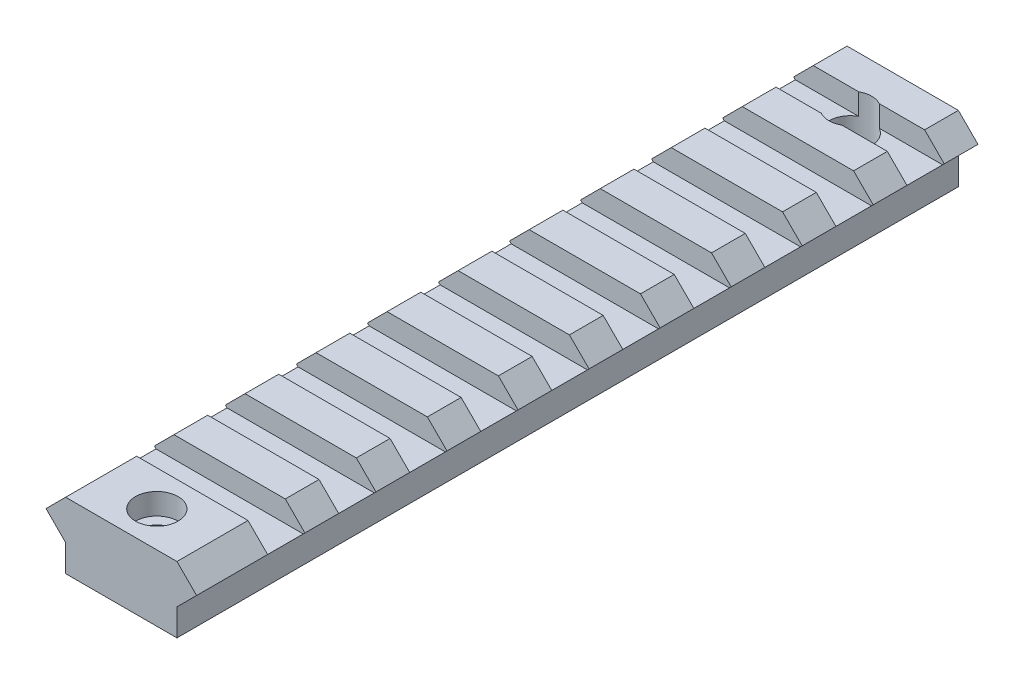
from build123d import *

# Parameters (mm, degrees)
EXTRUDE_1_DEPTH          = 110
SKETCH_3_W               = 21.2
SKETCH_3_H               = 5.25
CUT_EXTRUDE_1_DEPTH      = 3
SKETCH_4_R               = 3
CUT_EXTRUDE_2_DEPTH      = 3
SKETCH_5_R               = 1.5
CUT_EXTRUDE_3_DEPTH      = 114.880982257
SKETCH_6_R               = 1.5
CUT_EXTRUDE_4_DEPTH      = 114.880982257
CUT_EXTRUDE_5_DEPTH      = 114.880982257
CUT_EXTRUDE_5_DEPTH_BACK = 3
SKETCH_7_R               = 3


with BuildPart() as part:
    # Sketch 2 → Extrude 1 (new body)
    with BuildSketch(Plane.XY):
        Polygon((-26.026243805, 24.439556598), (-26.026243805, 29.969556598), (-28.791243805, 27.204556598), align=None)
        Polygon((-10.356243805, 29.969556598), (-26.026243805, 29.969556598), (-26.026243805, 24.439556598), (-26.026243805, 20.649556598), (-10.356243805, 20.649556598), (-10.356243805, 24.439556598), align=None)
        Polygon((-7.591243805, 27.204556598), (-10.356243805, 29.969556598), (-10.356243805, 24.439556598), align=None)
    extrude(amount=EXTRUDE_1_DEPTH)

    # Sketch 3 → Cut-Extrude 1 (cut)
    with BuildSketch(Plane(origin=(0, 29.969556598, 0), x_dir=(1, 0, 0), z_dir=(0, 1, 0))):
        with Locations((-18.191243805, -7.375)):
            Rectangle(SKETCH_3_W, SKETCH_3_H)
        with Locations((-18.191243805, -17.375)):
            Rectangle(SKETCH_3_W, SKETCH_3_H)
        with Locations((-18.191243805, -27.375)):
            Rectangle(SKETCH_3_W, SKETCH_3_H)
        with Locations((-18.191243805, -37.375)):
            Rectangle(SKETCH_3_W, SKETCH_3_H)
        with Locations((-18.191243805, -47.375)):
            Rectangle(SKETCH_3_W, SKETCH_3_H)
        with Locations((-18.191243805, -57.375)):
            Rectangle(SKETCH_3_W, SKETCH_3_H)
        with Locations((-18.191243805, -67.375)):
            Rectangle(SKETCH_3_W, SKETCH_3_H)
        with Locations((-18.191243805, -77.375)):
            Rectangle(SKETCH_3_W, SKETCH_3_H)
        with Locations((-18.191243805, -87.375)):
            Rectangle(SKETCH_3_W, SKETCH_3_H)
        with Locations((-18.191243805, -97.375)):
            Rectangle(SKETCH_3_W, SKETCH_3_H)
    extrude(amount=-CUT_EXTRUDE_1_DEPTH, mode=Mode.SUBTRACT)

    # Sketch 4 → Cut-Extrude 2 (cut)
    with BuildSketch(Plane(origin=(0, 29.969556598, 0), x_dir=(1, 0, 0), z_dir=(0, 1, 0))):
        with Locations(Location((-18.191243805, -105, 0), (0, 0, 180))):
            Circle(SKETCH_4_R)
    extrude(amount=-CUT_EXTRUDE_2_DEPTH, mode=Mode.SUBTRACT)

    # Sketch 5 → Cut-Extrude 3 (cut, through all)
    with BuildSketch(Plane(origin=(0, 26.969556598, 0), x_dir=(1, 0, 0), z_dir=(0, 1, 0))):
        with Locations(Location((-18.191243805, -105, 0), (0, 0, 180))):
            Circle(SKETCH_5_R)
    extrude(amount=-CUT_EXTRUDE_3_DEPTH, mode=Mode.SUBTRACT)

    # Sketch 6 → Cut-Extrude 4 (cut, through all)
    with BuildSketch(Plane(origin=(0, 26.969556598, 0), x_dir=(1, 0, 0), z_dir=(0, 1, 0))):
        with Locations(Location((-18.191243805, -7.375, 0), (0, 0, 180))):
            Circle(SKETCH_6_R)
    extrude(amount=-CUT_EXTRUDE_4_DEPTH, mode=Mode.SUBTRACT)

    # Sketch 7 → Cut-Extrude 5 (cut, two sides: drawn at the far end of the back side and taken through both)
    with BuildSketch(Plane(origin=(0, 26.969556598, 0), x_dir=(1, 0, 0), z_dir=(0, 1, 0)).offset(-CUT_EXTRUDE_5_DEPTH_BACK)):
        with Locations(Location((-18.191243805, -7.375, 0), (0, 0, 180))):
            Circle(SKETCH_7_R)
    extrude(amount=CUT_EXTRUDE_5_DEPTH + CUT_EXTRUDE_5_DEPTH_BACK, mode=Mode.SUBTRACT)


solid = part.part
